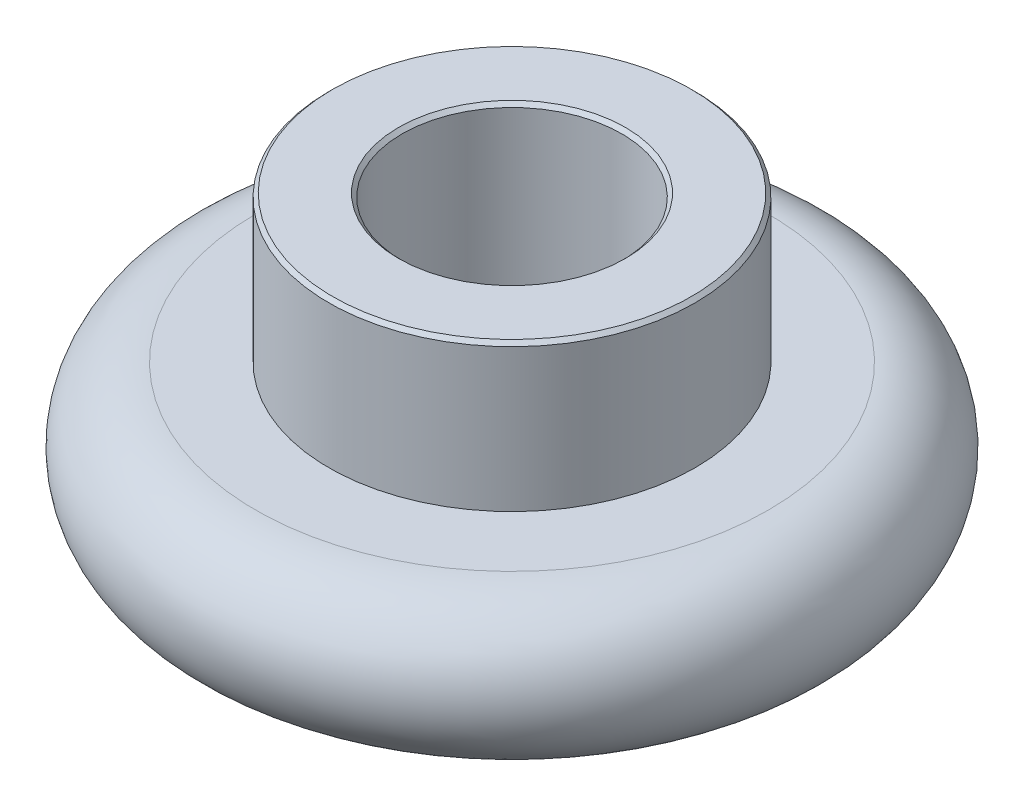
ISO-10303-21;
HEADER;
FILE_DESCRIPTION(('STEP AP214'),'2;1');
FILE_NAME('part.step','',(''),(''),'','','');
FILE_SCHEMA(('AUTOMOTIVE_DESIGN { 1 0 10303 214 1 1 1 1 }'));
ENDSEC;
DATA;
#1=APPLICATION_CONTEXT('core data for automotive mechanical design processes');
#2=APPLICATION_PROTOCOL_DEFINITION('international standard','automotive_design',2000,#1);
#3=PRODUCT_CONTEXT('',#1,'mechanical');
#4=PRODUCT('Part','Part','',(#3));
#5=PRODUCT_RELATED_PRODUCT_CATEGORY('part','',(#4));
#6=PRODUCT_DEFINITION_FORMATION('','',#4);
#7=PRODUCT_DEFINITION_CONTEXT('part definition',#1,'design');
#8=PRODUCT_DEFINITION('design','',#6,#7);
#9=PRODUCT_DEFINITION_SHAPE('','',#8);
#10=(LENGTH_UNIT() NAMED_UNIT(*) SI_UNIT(.MILLI.,.METRE.));
#11=(NAMED_UNIT(*) PLANE_ANGLE_UNIT() SI_UNIT($,.RADIAN.));
#12=(NAMED_UNIT(*) SI_UNIT($,.STERADIAN.) SOLID_ANGLE_UNIT());
#13=UNCERTAINTY_MEASURE_WITH_UNIT(LENGTH_MEASURE(1.E-05),#10,'distance_accuracy_value','');
#14=(GEOMETRIC_REPRESENTATION_CONTEXT(3) GLOBAL_UNCERTAINTY_ASSIGNED_CONTEXT((#13)) GLOBAL_UNIT_ASSIGNED_CONTEXT((#10,
#11,#12)) REPRESENTATION_CONTEXT('',''));
#15=CARTESIAN_POINT('',(0.,0.,0.));
#16=DIRECTION('',(0.,0.,1.));
#17=DIRECTION('',(1.,0.,0.));
#18=AXIS2_PLACEMENT_3D('',#15,#16,#17);
#19=CARTESIAN_POINT('',(0.,10.,0.));
#20=DIRECTION('',(0.,1.,0.));
#21=DIRECTION('',(-1.,0.,0.));
#22=AXIS2_PLACEMENT_3D('',#19,#20,#21);
#23=PLANE('',#22);
#24=CARTESIAN_POINT('',(0.,10.,0.));
#25=DIRECTION('',(0.,1.,0.));
#26=DIRECTION('',(-1.,0.,0.));
#27=AXIS2_PLACEMENT_3D('',#24,#25,#26);
#28=CIRCLE('',#27,14.5);
#29=CARTESIAN_POINT('',(-14.5,10.,0.));
#30=VERTEX_POINT('',#29);
#31=EDGE_CURVE('E52',#30,#30,#28,.T.);
#32=ORIENTED_EDGE('',*,*,#31,.T.);
#33=EDGE_LOOP('',(#32));
#34=FACE_BOUND('',#33,.T.);
#35=ADVANCED_FACE('F29',(#34),#23,.T.);
#36=CARTESIAN_POINT('',(0.,10.,0.));
#37=DIRECTION('',(0.,1.,0.));
#38=DIRECTION('',(-1.,0.,0.));
#39=AXIS2_PLACEMENT_3D('',#36,#37,#38);
#40=CYLINDRICAL_SURFACE('',#39,15.);
#41=CARTESIAN_POINT('',(0.,10.5,0.));
#42=DIRECTION('',(0.,1.,0.));
#43=DIRECTION('',(-1.,0.,0.));
#44=AXIS2_PLACEMENT_3D('',#41,#42,#43);
#45=CIRCLE('',#44,15.);
#46=CARTESIAN_POINT('',(-15.,10.5,0.));
#47=VERTEX_POINT('',#46);
#48=EDGE_CURVE('E44',#47,#47,#45,.F.);
#49=ORIENTED_EDGE('',*,*,#48,.T.);
#50=EDGE_LOOP('',(#49));
#51=FACE_BOUND('',#50,.T.);
#52=CARTESIAN_POINT('',(0.,39.5,0.));
#53=DIRECTION('',(0.,1.,0.));
#54=DIRECTION('',(-1.,0.,0.));
#55=AXIS2_PLACEMENT_3D('',#52,#53,#54);
#56=CIRCLE('',#55,15.);
#57=CARTESIAN_POINT('',(-15.,39.5,0.));
#58=VERTEX_POINT('',#57);
#59=EDGE_CURVE('E49',#58,#58,#56,.T.);
#60=ORIENTED_EDGE('',*,*,#59,.T.);
#61=EDGE_LOOP('',(#60));
#62=FACE_BOUND('',#61,.T.);
#63=ADVANCED_FACE('F82',(#51,#62),#40,.F.);
#64=CARTESIAN_POINT('',(-15.,40.,0.));
#65=DIRECTION('',(0.,1.,0.));
#66=DIRECTION('',(-1.,0.,0.));
#67=AXIS2_PLACEMENT_3D('',#64,#65,#66);
#68=PLANE('',#67);
#69=CARTESIAN_POINT('',(0.,40.,0.));
#70=DIRECTION('',(0.,1.,0.));
#71=DIRECTION('',(-1.,0.,0.));
#72=AXIS2_PLACEMENT_3D('',#69,#70,#71);
#73=CIRCLE('',#72,15.5);
#74=CARTESIAN_POINT('',(-15.5,40.,0.));
#75=VERTEX_POINT('',#74);
#76=EDGE_CURVE('E36',#75,#75,#73,.F.);
#77=ORIENTED_EDGE('',*,*,#76,.T.);
#78=EDGE_LOOP('',(#77));
#79=FACE_BOUND('',#78,.T.);
#80=CARTESIAN_POINT('',(0.,40.,0.));
#81=DIRECTION('',(0.,1.,0.));
#82=DIRECTION('',(-1.,0.,0.));
#83=AXIS2_PLACEMENT_3D('',#80,#81,#82);
#84=CIRCLE('',#83,24.5);
#85=CARTESIAN_POINT('',(-24.5,40.,0.));
#86=VERTEX_POINT('',#85);
#87=EDGE_CURVE('E40',#86,#86,#84,.T.);
#88=ORIENTED_EDGE('',*,*,#87,.T.);
#89=EDGE_LOOP('',(#88));
#90=FACE_BOUND('',#89,.T.);
#91=ADVANCED_FACE('F88',(#79,#90),#68,.T.);
#92=CARTESIAN_POINT('',(0.,10.,0.));
#93=DIRECTION('',(0.,1.,0.));
#94=DIRECTION('',(-1.,0.,0.));
#95=AXIS2_PLACEMENT_3D('',#92,#93,#94);
#96=CYLINDRICAL_SURFACE('',#95,25.);
#97=CARTESIAN_POINT('',(0.,39.5,0.));
#98=DIRECTION('',(0.,1.,0.));
#99=DIRECTION('',(-1.,0.,0.));
#100=AXIS2_PLACEMENT_3D('',#97,#98,#99);
#101=CIRCLE('',#100,25.);
#102=CARTESIAN_POINT('',(-25.,39.5,0.));
#103=VERTEX_POINT('',#102);
#104=EDGE_CURVE('E10',#103,#103,#101,.F.);
#105=ORIENTED_EDGE('',*,*,#104,.T.);
#106=EDGE_LOOP('',(#105));
#107=FACE_BOUND('',#106,.T.);
#108=CARTESIAN_POINT('',(0.,20.,0.));
#109=DIRECTION('',(0.,1.,0.));
#110=DIRECTION('',(-1.,0.,0.));
#111=AXIS2_PLACEMENT_3D('',#108,#109,#110);
#112=CIRCLE('',#111,25.);
#113=CARTESIAN_POINT('',(-25.,20.,0.));
#114=VERTEX_POINT('',#113);
#115=EDGE_CURVE('E55',#114,#114,#112,.T.);
#116=ORIENTED_EDGE('',*,*,#115,.T.);
#117=EDGE_LOOP('',(#116));
#118=FACE_BOUND('',#117,.T.);
#119=ADVANCED_FACE('F107',(#107,#118),#96,.T.);
#120=CARTESIAN_POINT('',(-25.,20.,0.));
#121=DIRECTION('',(0.,1.,0.));
#122=DIRECTION('',(-1.,0.,0.));
#123=AXIS2_PLACEMENT_3D('',#120,#121,#122);
#124=PLANE('',#123);
#125=CARTESIAN_POINT('',(0.,20.,0.));
#126=DIRECTION('',(0.,1.,0.));
#127=DIRECTION('',(-1.,0.,0.));
#128=AXIS2_PLACEMENT_3D('',#125,#126,#127);
#129=CIRCLE('',#128,35.);
#130=CARTESIAN_POINT('',(-35.,20.,0.));
#131=VERTEX_POINT('',#130);
#132=EDGE_CURVE('E58',#131,#131,#129,.T.);
#133=ORIENTED_EDGE('',*,*,#132,.T.);
#134=EDGE_LOOP('',(#133));
#135=FACE_BOUND('',#134,.T.);
#136=ORIENTED_EDGE('',*,*,#115,.F.);
#137=EDGE_LOOP('',(#136));
#138=FACE_BOUND('',#137,.T.);
#139=ADVANCED_FACE('F79',(#135,#138),#124,.T.);
#140=CARTESIAN_POINT('',(0.,10.,0.));
#141=DIRECTION('',(0.,1.,0.));
#142=DIRECTION('',(-1.,0.,0.));
#143=AXIS2_PLACEMENT_3D('',#140,#141,#142);
#144=TOROIDAL_SURFACE('',#143,35.,10.);
#145=CARTESIAN_POINT('',(0.,0.,0.));
#146=DIRECTION('',(0.,1.,0.));
#147=DIRECTION('',(-1.,0.,0.));
#148=AXIS2_PLACEMENT_3D('',#145,#146,#147);
#149=CIRCLE('',#148,35.);
#150=CARTESIAN_POINT('',(-35.,0.,0.));
#151=VERTEX_POINT('',#150);
#152=EDGE_CURVE('E61',#151,#151,#149,.T.);
#153=ORIENTED_EDGE('',*,*,#152,.T.);
#154=EDGE_LOOP('',(#153));
#155=FACE_BOUND('',#154,.T.);
#156=ORIENTED_EDGE('',*,*,#132,.F.);
#157=EDGE_LOOP('',(#156));
#158=FACE_BOUND('',#157,.T.);
#159=ADVANCED_FACE('F65',(#155,#158),#144,.T.);
#160=CARTESIAN_POINT('',(0.,0.,0.));
#161=DIRECTION('',(0.,-1.,0.));
#162=DIRECTION('',(1.,0.,0.));
#163=AXIS2_PLACEMENT_3D('',#160,#161,#162);
#164=PLANE('',#163);
#165=ORIENTED_EDGE('',*,*,#152,.F.);
#166=EDGE_LOOP('',(#165));
#167=FACE_BOUND('',#166,.T.);
#168=ADVANCED_FACE('F68',(#167),#164,.T.);
#169=CARTESIAN_POINT('',(0.,10.,0.));
#170=DIRECTION('',(0.,1.,0.));
#171=DIRECTION('',(-1.,0.,0.));
#172=AXIS2_PLACEMENT_3D('',#169,#170,#171);
#173=CONICAL_SURFACE('',#172,14.5,0.785398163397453);
#174=ORIENTED_EDGE('',*,*,#48,.F.);
#175=EDGE_LOOP('',(#174));
#176=FACE_BOUND('',#175,.T.);
#177=ORIENTED_EDGE('',*,*,#31,.F.);
#178=EDGE_LOOP('',(#177));
#179=FACE_BOUND('',#178,.T.);
#180=ADVANCED_FACE('F70',(#176,#179),#173,.F.);
#181=CARTESIAN_POINT('',(0.,39.5,0.));
#182=DIRECTION('',(0.,1.,0.));
#183=DIRECTION('',(-1.,0.,0.));
#184=AXIS2_PLACEMENT_3D('',#181,#182,#183);
#185=CONICAL_SURFACE('',#184,15.,0.785398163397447);
#186=ORIENTED_EDGE('',*,*,#76,.F.);
#187=EDGE_LOOP('',(#186));
#188=FACE_BOUND('',#187,.T.);
#189=ORIENTED_EDGE('',*,*,#59,.F.);
#190=EDGE_LOOP('',(#189));
#191=FACE_BOUND('',#190,.T.);
#192=ADVANCED_FACE('F76',(#188,#191),#185,.F.);
#193=CARTESIAN_POINT('',(0.,40.,0.));
#194=DIRECTION('',(0.,-1.,0.));
#195=DIRECTION('',(1.,0.,0.));
#196=AXIS2_PLACEMENT_3D('',#193,#194,#195);
#197=CONICAL_SURFACE('',#196,24.5,0.785398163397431);
#198=ORIENTED_EDGE('',*,*,#104,.F.);
#199=EDGE_LOOP('',(#198));
#200=FACE_BOUND('',#199,.T.);
#201=ORIENTED_EDGE('',*,*,#87,.F.);
#202=EDGE_LOOP('',(#201));
#203=FACE_BOUND('',#202,.T.);
#204=ADVANCED_FACE('F31',(#200,#203),#197,.T.);
#205=CLOSED_SHELL('',(#35,#63,#91,#119,#139,#159,#168,#180,#192,#204));
#206=MANIFOLD_SOLID_BREP('B2',#205);
#207=ADVANCED_BREP_SHAPE_REPRESENTATION('',(#18,#206),#14);
#208=SHAPE_DEFINITION_REPRESENTATION(#9,#207);
ENDSEC;
END-ISO-10303-21;
